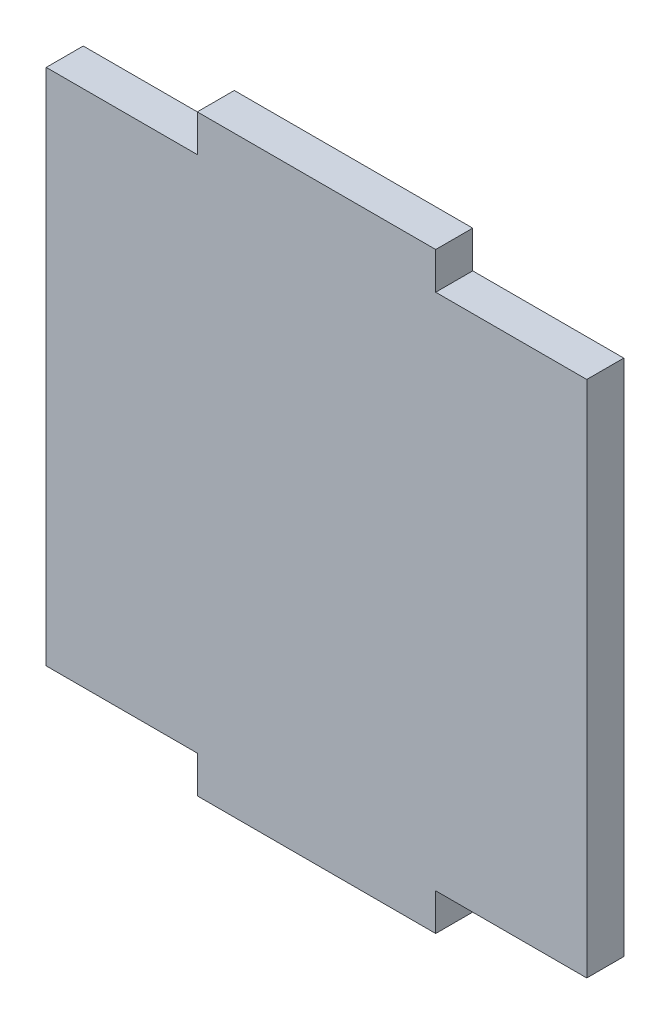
ISO-10303-21;
HEADER;
FILE_DESCRIPTION(('STEP AP214'),'2;1');
FILE_NAME('part.step','',(''),(''),'','','');
FILE_SCHEMA(('AUTOMOTIVE_DESIGN { 1 0 10303 214 1 1 1 1 }'));
ENDSEC;
DATA;
#1=APPLICATION_CONTEXT('core data for automotive mechanical design processes');
#2=APPLICATION_PROTOCOL_DEFINITION('international standard','automotive_design',2000,#1);
#3=PRODUCT_CONTEXT('',#1,'mechanical');
#4=PRODUCT('Part','Part','',(#3));
#5=PRODUCT_RELATED_PRODUCT_CATEGORY('part','',(#4));
#6=PRODUCT_DEFINITION_FORMATION('','',#4);
#7=PRODUCT_DEFINITION_CONTEXT('part definition',#1,'design');
#8=PRODUCT_DEFINITION('design','',#6,#7);
#9=PRODUCT_DEFINITION_SHAPE('','',#8);
#10=(LENGTH_UNIT() NAMED_UNIT(*) SI_UNIT(.MILLI.,.METRE.));
#11=(NAMED_UNIT(*) PLANE_ANGLE_UNIT() SI_UNIT($,.RADIAN.));
#12=(NAMED_UNIT(*) SI_UNIT($,.STERADIAN.) SOLID_ANGLE_UNIT());
#13=UNCERTAINTY_MEASURE_WITH_UNIT(LENGTH_MEASURE(1.E-05),#10,'distance_accuracy_value','');
#14=(GEOMETRIC_REPRESENTATION_CONTEXT(3) GLOBAL_UNCERTAINTY_ASSIGNED_CONTEXT((#13)) GLOBAL_UNIT_ASSIGNED_CONTEXT((#10,
#11,#12)) REPRESENTATION_CONTEXT('',''));
#15=CARTESIAN_POINT('',(0.,0.,0.));
#16=DIRECTION('',(0.,0.,1.));
#17=DIRECTION('',(1.,0.,0.));
#18=AXIS2_PLACEMENT_3D('',#15,#16,#17);
#19=CARTESIAN_POINT('',(18.249101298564,-2.5,2.5));
#20=DIRECTION('',(0.,-1.,0.));
#21=DIRECTION('',(0.,0.,-1.));
#22=AXIS2_PLACEMENT_3D('',#19,#20,#21);
#23=PLANE('',#22);
#24=DIRECTION('',(-1.,0.,0.));
#25=VECTOR('',#24,1.);
#26=CARTESIAN_POINT('',(18.249101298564,-2.5,0.));
#27=LINE('',#26,#25);
#28=CARTESIAN_POINT('',(18.249101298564,-2.5,0.));
#29=VERTEX_POINT('',#28);
#30=CARTESIAN_POINT('',(8.049101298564,-2.5,0.));
#31=VERTEX_POINT('',#30);
#32=EDGE_CURVE('E155',#29,#31,#27,.T.);
#33=ORIENTED_EDGE('',*,*,#32,.T.);
#34=DIRECTION('',(0.,0.,-1.));
#35=VECTOR('',#34,1.);
#36=CARTESIAN_POINT('',(8.049101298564,-2.5,2.5));
#37=LINE('',#36,#35);
#38=CARTESIAN_POINT('',(8.049101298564,-2.5,2.5));
#39=VERTEX_POINT('',#38);
#40=EDGE_CURVE('E11',#39,#31,#37,.T.);
#41=ORIENTED_EDGE('',*,*,#40,.F.);
#42=DIRECTION('',(-1.,0.,0.));
#43=VECTOR('',#42,1.);
#44=CARTESIAN_POINT('',(18.249101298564,-2.5,2.5));
#45=LINE('',#44,#43);
#46=CARTESIAN_POINT('',(18.249101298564,-2.5,2.5));
#47=VERTEX_POINT('',#46);
#48=EDGE_CURVE('E102',#47,#39,#45,.T.);
#49=ORIENTED_EDGE('',*,*,#48,.F.);
#50=DIRECTION('',(0.,0.,-1.));
#51=VECTOR('',#50,1.);
#52=CARTESIAN_POINT('',(18.249101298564,-2.5,2.5));
#53=LINE('',#52,#51);
#54=EDGE_CURVE('E53',#47,#29,#53,.T.);
#55=ORIENTED_EDGE('',*,*,#54,.T.);
#56=EDGE_LOOP('',(#33,#41,#49,#55));
#57=FACE_BOUND('',#56,.T.);
#58=ADVANCED_FACE('F37',(#57),#23,.F.);
#59=CARTESIAN_POINT('',(8.049101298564,0.,2.5));
#60=DIRECTION('',(1.,0.,0.));
#61=DIRECTION('',(0.,1.,0.));
#62=AXIS2_PLACEMENT_3D('',#59,#60,#61);
#63=PLANE('',#62);
#64=DIRECTION('',(0.,-1.,0.));
#65=VECTOR('',#64,1.);
#66=CARTESIAN_POINT('',(8.049101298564,0.,0.));
#67=LINE('',#66,#65);
#68=CARTESIAN_POINT('',(8.049101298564,0.,0.));
#69=VERTEX_POINT('',#68);
#70=EDGE_CURVE('E157',#69,#31,#67,.T.);
#71=ORIENTED_EDGE('',*,*,#70,.F.);
#72=DIRECTION('',(0.,0.,-1.));
#73=VECTOR('',#72,1.);
#74=CARTESIAN_POINT('',(8.049101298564,0.,2.5));
#75=LINE('',#74,#73);
#76=CARTESIAN_POINT('',(8.049101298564,0.,2.5));
#77=VERTEX_POINT('',#76);
#78=EDGE_CURVE('E45',#77,#69,#75,.T.);
#79=ORIENTED_EDGE('',*,*,#78,.F.);
#80=DIRECTION('',(0.,-1.,0.));
#81=VECTOR('',#80,1.);
#82=CARTESIAN_POINT('',(8.049101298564,0.,2.5));
#83=LINE('',#82,#81);
#84=EDGE_CURVE('E260',#77,#39,#83,.T.);
#85=ORIENTED_EDGE('',*,*,#84,.T.);
#86=ORIENTED_EDGE('',*,*,#40,.T.);
#87=EDGE_LOOP('',(#71,#79,#85,#86));
#88=FACE_BOUND('',#87,.T.);
#89=ADVANCED_FACE('F210',(#88),#63,.T.);
#90=CARTESIAN_POINT('',(-8.04910129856,0.,2.5));
#91=DIRECTION('',(0.,1.,0.));
#92=DIRECTION('',(0.,0.,1.));
#93=AXIS2_PLACEMENT_3D('',#90,#91,#92);
#94=PLANE('',#93);
#95=DIRECTION('',(1.,0.,0.));
#96=VECTOR('',#95,1.);
#97=CARTESIAN_POINT('',(-8.04910129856,0.,0.));
#98=LINE('',#97,#96);
#99=CARTESIAN_POINT('',(-8.04910129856,0.,0.));
#100=VERTEX_POINT('',#99);
#101=EDGE_CURVE('E160',#100,#69,#98,.T.);
#102=ORIENTED_EDGE('',*,*,#101,.F.);
#103=DIRECTION('',(0.,0.,-1.));
#104=VECTOR('',#103,1.);
#105=CARTESIAN_POINT('',(-8.04910129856,0.,2.5));
#106=LINE('',#105,#104);
#107=CARTESIAN_POINT('',(-8.04910129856,0.,2.5));
#108=VERTEX_POINT('',#107);
#109=EDGE_CURVE('E200',#108,#100,#106,.T.);
#110=ORIENTED_EDGE('',*,*,#109,.F.);
#111=DIRECTION('',(1.,0.,0.));
#112=VECTOR('',#111,1.);
#113=CARTESIAN_POINT('',(-8.04910129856,0.,2.5));
#114=LINE('',#113,#112);
#115=EDGE_CURVE('E207',#108,#77,#114,.T.);
#116=ORIENTED_EDGE('',*,*,#115,.T.);
#117=ORIENTED_EDGE('',*,*,#78,.T.);
#118=EDGE_LOOP('',(#102,#110,#116,#117));
#119=FACE_BOUND('',#118,.T.);
#120=ADVANCED_FACE('F205',(#119),#94,.T.);
#121=CARTESIAN_POINT('',(-8.04910129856,0.,2.5));
#122=DIRECTION('',(1.,0.,0.));
#123=DIRECTION('',(0.,1.,0.));
#124=AXIS2_PLACEMENT_3D('',#121,#122,#123);
#125=PLANE('',#124);
#126=DIRECTION('',(0.,-1.,0.));
#127=VECTOR('',#126,1.);
#128=CARTESIAN_POINT('',(-8.04910129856,0.,0.));
#129=LINE('',#128,#127);
#130=CARTESIAN_POINT('',(-8.04910129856,-2.5,0.));
#131=VERTEX_POINT('',#130);
#132=EDGE_CURVE('E163',#100,#131,#129,.T.);
#133=ORIENTED_EDGE('',*,*,#132,.T.);
#134=DIRECTION('',(0.,0.,-1.));
#135=VECTOR('',#134,1.);
#136=CARTESIAN_POINT('',(-8.04910129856,-2.5,2.5));
#137=LINE('',#136,#135);
#138=CARTESIAN_POINT('',(-8.04910129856,-2.5,2.5));
#139=VERTEX_POINT('',#138);
#140=EDGE_CURVE('E197',#139,#131,#137,.T.);
#141=ORIENTED_EDGE('',*,*,#140,.F.);
#142=DIRECTION('',(0.,-1.,0.));
#143=VECTOR('',#142,1.);
#144=CARTESIAN_POINT('',(-8.04910129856,0.,2.5));
#145=LINE('',#144,#143);
#146=EDGE_CURVE('E227',#108,#139,#145,.T.);
#147=ORIENTED_EDGE('',*,*,#146,.F.);
#148=ORIENTED_EDGE('',*,*,#109,.T.);
#149=EDGE_LOOP('',(#133,#141,#147,#148));
#150=FACE_BOUND('',#149,.T.);
#151=ADVANCED_FACE('F218',(#150),#125,.F.);
#152=CARTESIAN_POINT('',(-8.04910129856,-2.5,2.5));
#153=DIRECTION('',(0.,-1.,0.));
#154=DIRECTION('',(0.,0.,-1.));
#155=AXIS2_PLACEMENT_3D('',#152,#153,#154);
#156=PLANE('',#155);
#157=DIRECTION('',(-1.,0.,0.));
#158=VECTOR('',#157,1.);
#159=CARTESIAN_POINT('',(-8.04910129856,-2.5,0.));
#160=LINE('',#159,#158);
#161=CARTESIAN_POINT('',(-18.24910129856,-2.5,0.));
#162=VERTEX_POINT('',#161);
#163=EDGE_CURVE('E165',#131,#162,#160,.T.);
#164=ORIENTED_EDGE('',*,*,#163,.T.);
#165=DIRECTION('',(0.,0.,-1.));
#166=VECTOR('',#165,1.);
#167=CARTESIAN_POINT('',(-18.24910129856,-2.5,2.5));
#168=LINE('',#167,#166);
#169=CARTESIAN_POINT('',(-18.24910129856,-2.5,2.5));
#170=VERTEX_POINT('',#169);
#171=EDGE_CURVE('E194',#170,#162,#168,.T.);
#172=ORIENTED_EDGE('',*,*,#171,.F.);
#173=DIRECTION('',(-1.,0.,0.));
#174=VECTOR('',#173,1.);
#175=CARTESIAN_POINT('',(-8.04910129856,-2.5,2.5));
#176=LINE('',#175,#174);
#177=EDGE_CURVE('E224',#139,#170,#176,.T.);
#178=ORIENTED_EDGE('',*,*,#177,.F.);
#179=ORIENTED_EDGE('',*,*,#140,.T.);
#180=EDGE_LOOP('',(#164,#172,#178,#179));
#181=FACE_BOUND('',#180,.T.);
#182=ADVANCED_FACE('F222',(#181),#156,.F.);
#183=CARTESIAN_POINT('',(-18.24910129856,-2.5,2.5));
#184=DIRECTION('',(1.,0.,0.));
#185=DIRECTION('',(0.,0.,-1.));
#186=AXIS2_PLACEMENT_3D('',#183,#184,#185);
#187=PLANE('',#186);
#188=DIRECTION('',(0.,-1.,0.));
#189=VECTOR('',#188,1.);
#190=CARTESIAN_POINT('',(-18.24910129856,-2.5,0.));
#191=LINE('',#190,#189);
#192=CARTESIAN_POINT('',(-18.24910129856,-37.5,0.));
#193=VERTEX_POINT('',#192);
#194=EDGE_CURVE('E167',#162,#193,#191,.T.);
#195=ORIENTED_EDGE('',*,*,#194,.T.);
#196=DIRECTION('',(0.,0.,-1.));
#197=VECTOR('',#196,1.);
#198=CARTESIAN_POINT('',(-18.24910129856,-37.5,2.5));
#199=LINE('',#198,#197);
#200=CARTESIAN_POINT('',(-18.24910129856,-37.5,2.5));
#201=VERTEX_POINT('',#200);
#202=EDGE_CURVE('E192',#201,#193,#199,.T.);
#203=ORIENTED_EDGE('',*,*,#202,.F.);
#204=DIRECTION('',(0.,-1.,0.));
#205=VECTOR('',#204,1.);
#206=CARTESIAN_POINT('',(-18.24910129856,-2.5,2.5));
#207=LINE('',#206,#205);
#208=EDGE_CURVE('E226',#170,#201,#207,.T.);
#209=ORIENTED_EDGE('',*,*,#208,.F.);
#210=ORIENTED_EDGE('',*,*,#171,.T.);
#211=EDGE_LOOP('',(#195,#203,#209,#210));
#212=FACE_BOUND('',#211,.T.);
#213=ADVANCED_FACE('F272',(#212),#187,.F.);
#214=CARTESIAN_POINT('',(-8.04910129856,-37.5,2.5));
#215=DIRECTION('',(0.,-1.,0.));
#216=DIRECTION('',(0.,0.,-1.));
#217=AXIS2_PLACEMENT_3D('',#214,#215,#216);
#218=PLANE('',#217);
#219=DIRECTION('',(-1.,0.,0.));
#220=VECTOR('',#219,1.);
#221=CARTESIAN_POINT('',(-8.04910129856,-37.5,0.));
#222=LINE('',#221,#220);
#223=CARTESIAN_POINT('',(-8.04910129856,-37.5,0.));
#224=VERTEX_POINT('',#223);
#225=EDGE_CURVE('E170',#224,#193,#222,.T.);
#226=ORIENTED_EDGE('',*,*,#225,.F.);
#227=DIRECTION('',(0.,0.,-1.));
#228=VECTOR('',#227,1.);
#229=CARTESIAN_POINT('',(-8.04910129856,-37.5,2.5));
#230=LINE('',#229,#228);
#231=CARTESIAN_POINT('',(-8.04910129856,-37.5,2.5));
#232=VERTEX_POINT('',#231);
#233=EDGE_CURVE('E190',#232,#224,#230,.T.);
#234=ORIENTED_EDGE('',*,*,#233,.F.);
#235=DIRECTION('',(-1.,0.,0.));
#236=VECTOR('',#235,1.);
#237=CARTESIAN_POINT('',(-8.04910129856,-37.5,2.5));
#238=LINE('',#237,#236);
#239=EDGE_CURVE('E229',#232,#201,#238,.T.);
#240=ORIENTED_EDGE('',*,*,#239,.T.);
#241=ORIENTED_EDGE('',*,*,#202,.T.);
#242=EDGE_LOOP('',(#226,#234,#240,#241));
#243=FACE_BOUND('',#242,.T.);
#244=ADVANCED_FACE('F275',(#243),#218,.T.);
#245=CARTESIAN_POINT('',(-8.04910129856,-37.5,2.5));
#246=DIRECTION('',(1.,0.,0.));
#247=DIRECTION('',(0.,0.,-1.));
#248=AXIS2_PLACEMENT_3D('',#245,#246,#247);
#249=PLANE('',#248);
#250=DIRECTION('',(0.,-1.,0.));
#251=VECTOR('',#250,1.);
#252=CARTESIAN_POINT('',(-8.04910129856,-37.5,0.));
#253=LINE('',#252,#251);
#254=CARTESIAN_POINT('',(-8.04910129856,-40.,0.));
#255=VERTEX_POINT('',#254);
#256=EDGE_CURVE('E173',#224,#255,#253,.T.);
#257=ORIENTED_EDGE('',*,*,#256,.T.);
#258=DIRECTION('',(0.,0.,-1.));
#259=VECTOR('',#258,1.);
#260=CARTESIAN_POINT('',(-8.04910129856,-40.,2.5));
#261=LINE('',#260,#259);
#262=CARTESIAN_POINT('',(-8.04910129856,-40.,2.5));
#263=VERTEX_POINT('',#262);
#264=EDGE_CURVE('E187',#263,#255,#261,.T.);
#265=ORIENTED_EDGE('',*,*,#264,.F.);
#266=DIRECTION('',(0.,-1.,0.));
#267=VECTOR('',#266,1.);
#268=CARTESIAN_POINT('',(-8.04910129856,-37.5,2.5));
#269=LINE('',#268,#267);
#270=EDGE_CURVE('E236',#232,#263,#269,.T.);
#271=ORIENTED_EDGE('',*,*,#270,.F.);
#272=ORIENTED_EDGE('',*,*,#233,.T.);
#273=EDGE_LOOP('',(#257,#265,#271,#272));
#274=FACE_BOUND('',#273,.T.);
#275=ADVANCED_FACE('F241',(#274),#249,.F.);
#276=CARTESIAN_POINT('',(-8.04910129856,-40.,2.5));
#277=DIRECTION('',(0.,1.,0.));
#278=DIRECTION('',(0.,0.,1.));
#279=AXIS2_PLACEMENT_3D('',#276,#277,#278);
#280=PLANE('',#279);
#281=DIRECTION('',(1.,0.,0.));
#282=VECTOR('',#281,1.);
#283=CARTESIAN_POINT('',(-8.04910129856,-40.,0.));
#284=LINE('',#283,#282);
#285=CARTESIAN_POINT('',(8.049101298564,-40.,0.));
#286=VERTEX_POINT('',#285);
#287=EDGE_CURVE('E175',#255,#286,#284,.T.);
#288=ORIENTED_EDGE('',*,*,#287,.T.);
#289=DIRECTION('',(0.,0.,-1.));
#290=VECTOR('',#289,1.);
#291=CARTESIAN_POINT('',(8.049101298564,-40.,2.5));
#292=LINE('',#291,#290);
#293=CARTESIAN_POINT('',(8.049101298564,-40.,2.5));
#294=VERTEX_POINT('',#293);
#295=EDGE_CURVE('E140',#294,#286,#292,.T.);
#296=ORIENTED_EDGE('',*,*,#295,.F.);
#297=DIRECTION('',(1.,0.,0.));
#298=VECTOR('',#297,1.);
#299=CARTESIAN_POINT('',(-8.04910129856,-40.,2.5));
#300=LINE('',#299,#298);
#301=EDGE_CURVE('E146',#263,#294,#300,.T.);
#302=ORIENTED_EDGE('',*,*,#301,.F.);
#303=ORIENTED_EDGE('',*,*,#264,.T.);
#304=EDGE_LOOP('',(#288,#296,#302,#303));
#305=FACE_BOUND('',#304,.T.);
#306=ADVANCED_FACE('F245',(#305),#280,.F.);
#307=CARTESIAN_POINT('',(8.049101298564,-37.5,2.5));
#308=DIRECTION('',(1.,0.,0.));
#309=DIRECTION('',(0.,0.,-1.));
#310=AXIS2_PLACEMENT_3D('',#307,#308,#309);
#311=PLANE('',#310);
#312=DIRECTION('',(0.,-1.,0.));
#313=VECTOR('',#312,1.);
#314=CARTESIAN_POINT('',(8.049101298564,-37.5,0.));
#315=LINE('',#314,#313);
#316=CARTESIAN_POINT('',(8.049101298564,-37.5,0.));
#317=VERTEX_POINT('',#316);
#318=EDGE_CURVE('E136',#317,#286,#315,.T.);
#319=ORIENTED_EDGE('',*,*,#318,.F.);
#320=DIRECTION('',(0.,0.,-1.));
#321=VECTOR('',#320,1.);
#322=CARTESIAN_POINT('',(8.049101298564,-37.5,2.5));
#323=LINE('',#322,#321);
#324=CARTESIAN_POINT('',(8.049101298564,-37.5,2.5));
#325=VERTEX_POINT('',#324);
#326=EDGE_CURVE('E131',#325,#317,#323,.T.);
#327=ORIENTED_EDGE('',*,*,#326,.F.);
#328=DIRECTION('',(0.,-1.,0.));
#329=VECTOR('',#328,1.);
#330=CARTESIAN_POINT('',(8.049101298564,-37.5,2.5));
#331=LINE('',#330,#329);
#332=EDGE_CURVE('E134',#325,#294,#331,.T.);
#333=ORIENTED_EDGE('',*,*,#332,.T.);
#334=ORIENTED_EDGE('',*,*,#295,.T.);
#335=EDGE_LOOP('',(#319,#327,#333,#334));
#336=FACE_BOUND('',#335,.T.);
#337=ADVANCED_FACE('F133',(#336),#311,.T.);
#338=CARTESIAN_POINT('',(18.249101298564,-37.5,2.5));
#339=DIRECTION('',(0.,-1.,0.));
#340=DIRECTION('',(0.,0.,-1.));
#341=AXIS2_PLACEMENT_3D('',#338,#339,#340);
#342=PLANE('',#341);
#343=DIRECTION('',(-1.,0.,0.));
#344=VECTOR('',#343,1.);
#345=CARTESIAN_POINT('',(18.249101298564,-37.5,0.));
#346=LINE('',#345,#344);
#347=CARTESIAN_POINT('',(18.249101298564,-37.5,0.));
#348=VERTEX_POINT('',#347);
#349=EDGE_CURVE('E179',#348,#317,#346,.T.);
#350=ORIENTED_EDGE('',*,*,#349,.F.);
#351=DIRECTION('',(0.,0.,-1.));
#352=VECTOR('',#351,1.);
#353=CARTESIAN_POINT('',(18.249101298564,-37.5,2.5));
#354=LINE('',#353,#352);
#355=CARTESIAN_POINT('',(18.249101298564,-37.5,2.5));
#356=VERTEX_POINT('',#355);
#357=EDGE_CURVE('E90',#356,#348,#354,.T.);
#358=ORIENTED_EDGE('',*,*,#357,.F.);
#359=DIRECTION('',(-1.,0.,0.));
#360=VECTOR('',#359,1.);
#361=CARTESIAN_POINT('',(18.249101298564,-37.5,2.5));
#362=LINE('',#361,#360);
#363=EDGE_CURVE('E144',#356,#325,#362,.T.);
#364=ORIENTED_EDGE('',*,*,#363,.T.);
#365=ORIENTED_EDGE('',*,*,#326,.T.);
#366=EDGE_LOOP('',(#350,#358,#364,#365));
#367=FACE_BOUND('',#366,.T.);
#368=ADVANCED_FACE('F149',(#367),#342,.T.);
#369=CARTESIAN_POINT('',(18.249101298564,-2.5,2.5));
#370=DIRECTION('',(1.,0.,0.));
#371=DIRECTION('',(0.,1.,0.));
#372=AXIS2_PLACEMENT_3D('',#369,#370,#371);
#373=PLANE('',#372);
#374=DIRECTION('',(0.,-1.,0.));
#375=VECTOR('',#374,1.);
#376=CARTESIAN_POINT('',(18.249101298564,-2.5,0.));
#377=LINE('',#376,#375);
#378=EDGE_CURVE('E181',#29,#348,#377,.T.);
#379=ORIENTED_EDGE('',*,*,#378,.F.);
#380=ORIENTED_EDGE('',*,*,#54,.F.);
#381=DIRECTION('',(0.,-1.,0.));
#382=VECTOR('',#381,1.);
#383=CARTESIAN_POINT('',(18.249101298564,-2.5,2.5));
#384=LINE('',#383,#382);
#385=EDGE_CURVE('E150',#47,#356,#384,.T.);
#386=ORIENTED_EDGE('',*,*,#385,.T.);
#387=ORIENTED_EDGE('',*,*,#357,.T.);
#388=EDGE_LOOP('',(#379,#380,#386,#387));
#389=FACE_BOUND('',#388,.T.);
#390=ADVANCED_FACE('F246',(#389),#373,.T.);
#391=CARTESIAN_POINT('',(0.,0.,2.5));
#392=DIRECTION('',(0.,0.,1.));
#393=DIRECTION('',(1.,0.,0.));
#394=AXIS2_PLACEMENT_3D('',#391,#392,#393);
#395=PLANE('',#394);
#396=ORIENTED_EDGE('',*,*,#48,.T.);
#397=ORIENTED_EDGE('',*,*,#84,.F.);
#398=ORIENTED_EDGE('',*,*,#115,.F.);
#399=ORIENTED_EDGE('',*,*,#146,.T.);
#400=ORIENTED_EDGE('',*,*,#177,.T.);
#401=ORIENTED_EDGE('',*,*,#208,.T.);
#402=ORIENTED_EDGE('',*,*,#239,.F.);
#403=ORIENTED_EDGE('',*,*,#270,.T.);
#404=ORIENTED_EDGE('',*,*,#301,.T.);
#405=ORIENTED_EDGE('',*,*,#332,.F.);
#406=ORIENTED_EDGE('',*,*,#363,.F.);
#407=ORIENTED_EDGE('',*,*,#385,.F.);
#408=EDGE_LOOP('',(#396,#397,#398,#399,#400,#401,#402,#403,#404,#405,#406,#407));
#409=FACE_BOUND('',#408,.T.);
#410=ADVANCED_FACE('F143',(#409),#395,.T.);
#411=CARTESIAN_POINT('',(0.,0.,0.));
#412=DIRECTION('',(0.,0.,1.));
#413=DIRECTION('',(1.,0.,0.));
#414=AXIS2_PLACEMENT_3D('',#411,#412,#413);
#415=PLANE('',#414);
#416=ORIENTED_EDGE('',*,*,#32,.F.);
#417=ORIENTED_EDGE('',*,*,#378,.T.);
#418=ORIENTED_EDGE('',*,*,#349,.T.);
#419=ORIENTED_EDGE('',*,*,#318,.T.);
#420=ORIENTED_EDGE('',*,*,#287,.F.);
#421=ORIENTED_EDGE('',*,*,#256,.F.);
#422=ORIENTED_EDGE('',*,*,#225,.T.);
#423=ORIENTED_EDGE('',*,*,#194,.F.);
#424=ORIENTED_EDGE('',*,*,#163,.F.);
#425=ORIENTED_EDGE('',*,*,#132,.F.);
#426=ORIENTED_EDGE('',*,*,#101,.T.);
#427=ORIENTED_EDGE('',*,*,#70,.T.);
#428=EDGE_LOOP('',(#416,#417,#418,#419,#420,#421,#422,#423,#424,#425,#426,#427));
#429=FACE_BOUND('',#428,.T.);
#430=ADVANCED_FACE('F213',(#429),#415,.F.);
#431=CLOSED_SHELL('',(#58,#89,#120,#151,#182,#213,#244,#275,#306,#337,#368,#390,#410,#430));
#432=MANIFOLD_SOLID_BREP('B2',#431);
#433=ADVANCED_BREP_SHAPE_REPRESENTATION('',(#18,#432),#14);
#434=SHAPE_DEFINITION_REPRESENTATION(#9,#433);
ENDSEC;
END-ISO-10303-21;
